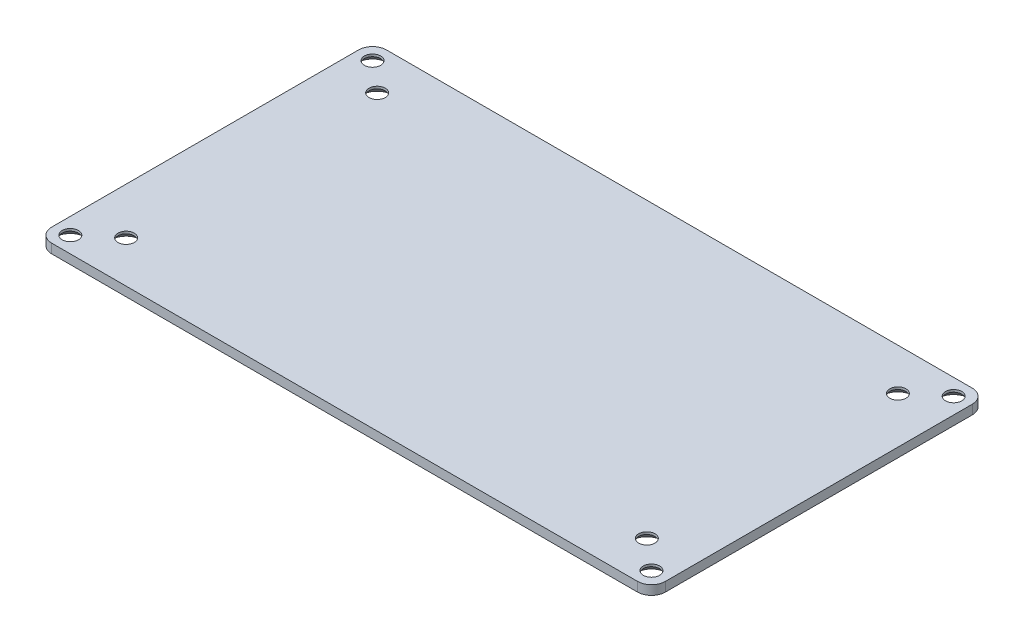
from build123d import *

# Parameters (mm, degrees)
EXTRUDE_1_DEPTH     = 2
SKETCH_2_R          = 1.75
CUT_EXTRUDE_1_DEPTH = 76.206382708
SKETCH_3_R          = 1.75
CUT_EXTRUDE_2_DEPTH = 76.206382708
CHAMFER_1_SIZE      = 1.5
SKETCH_4_R          = 6.25
CUT_EXTRUDE_3_DEPTH = 1


with BuildPart() as part:
    # Sketch 1 → Extrude 1 (new body)
    with BuildSketch(Plane(origin=(0, 0, 0), x_dir=(1, 0, 0), z_dir=(0, 1, 0))):
        with BuildLine():
            Line((-63, 36), (63, 36))
            ThreePointArc((63, 36), (65.121320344, 35.121320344), (66, 33))
            Line((66, 33), (66, -33))
            ThreePointArc((66, -33), (65.121320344, -35.121320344), (63, -36))
            Line((63, -36), (-63, -36))
            ThreePointArc((-63, -36), (-65.121320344, -35.121320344), (-66, -33))
            Line((-66, -33), (-66, 33))
            ThreePointArc((-66, 33), (-65.121320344, 35.121320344), (-63, 36))
        make_face()
    extrude(amount=EXTRUDE_1_DEPTH)

    # Sketch 2 → Cut-Extrude 1 (cut, through all)
    with BuildSketch(Plane(origin=(0, 2, 0), x_dir=(1, 0, 0), z_dir=(0, 1, 0))):
        with Locations(Location((-62.5, 32.5, 0), (0, 0, 270))):
            Circle(SKETCH_2_R)
        with Locations(Location((62.5, 32.5, 0), (0, 0, 270))):
            Circle(SKETCH_2_R)
        with Locations(Location((62.5, -32.5, 0), (0, 0, 270))):
            Circle(SKETCH_2_R)
        with Locations(Location((-62.5, -32.5, 0), (0, 0, 270))):
            Circle(SKETCH_2_R)
    extrude(amount=-CUT_EXTRUDE_1_DEPTH, mode=Mode.SUBTRACT)

    # Sketch 3 → Cut-Extrude 2 (cut, through all)
    with BuildSketch(Plane(origin=(0, 2, 0), x_dir=(1, 0, 0), z_dir=(0, 1, 0))):
        with Locations(Location((-56, 27, 0), (0, 0, 270))):
            Circle(SKETCH_3_R)
        with Locations(Location((56, 27, 0), (0, 0, 270))):
            Circle(SKETCH_3_R)
        with Locations(Location((56, -27, 0), (0, 0, 270))):
            Circle(SKETCH_3_R)
        with Locations(Location((-56, -27, 0), (0, 0, 270))):
            Circle(SKETCH_3_R)
    extrude(amount=-CUT_EXTRUDE_2_DEPTH, mode=Mode.SUBTRACT)

    # Chamfer 1
    chamfer_1_edges = [part.edges().sort_by_distance(p)[0] for p in [
        (-62.5, 0, 30.75),
        (62.5, 0, 30.75),
        (62.5, 0, -34.25),
        (-62.5, 0, -34.25),
        (-56, 0, 25.25),
        (56, 0, 25.25),
        (56, 0, -28.75),
        (-56, 0, -28.75),
    ]]
    chamfer(chamfer_1_edges, length=CHAMFER_1_SIZE)

    # Sketch 4 → Cut-Extrude 3 (cut)
    with BuildSketch(Plane.XZ):
        with Locations(Location((-45, 25, 0), (0, 0, 270))):
            Circle(SKETCH_4_R)
        with Locations(Location((45, 25, 0), (0, 0, 270))):
            Circle(SKETCH_4_R)
        with Locations(Location((-45, -25, 0), (0, 0, 270))):
            Circle(SKETCH_4_R)
        with Locations(Location((45, -25, 0), (0, 0, 270))):
            Circle(SKETCH_4_R)
    extrude(amount=-CUT_EXTRUDE_3_DEPTH, mode=Mode.SUBTRACT)


solid = part.part
